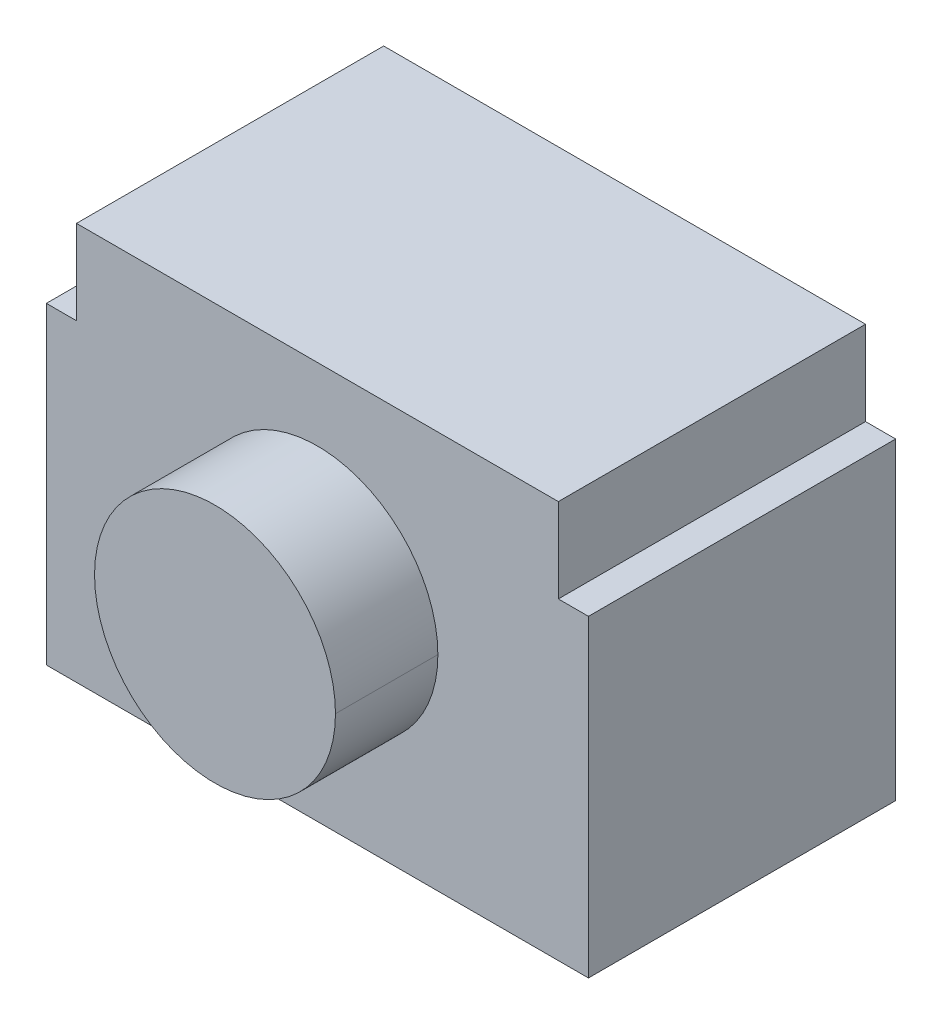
ISO-10303-21;
HEADER;
FILE_DESCRIPTION(('STEP AP214'),'2;1');
FILE_NAME('part.step','',(''),(''),'','','');
FILE_SCHEMA(('AUTOMOTIVE_DESIGN { 1 0 10303 214 1 1 1 1 }'));
ENDSEC;
DATA;
#1=APPLICATION_CONTEXT('core data for automotive mechanical design processes');
#2=APPLICATION_PROTOCOL_DEFINITION('international standard','automotive_design',2000,#1);
#3=PRODUCT_CONTEXT('',#1,'mechanical');
#4=PRODUCT('Part','Part','',(#3));
#5=PRODUCT_RELATED_PRODUCT_CATEGORY('part','',(#4));
#6=PRODUCT_DEFINITION_FORMATION('','',#4);
#7=PRODUCT_DEFINITION_CONTEXT('part definition',#1,'design');
#8=PRODUCT_DEFINITION('design','',#6,#7);
#9=PRODUCT_DEFINITION_SHAPE('','',#8);
#10=(LENGTH_UNIT() NAMED_UNIT(*) SI_UNIT(.MILLI.,.METRE.));
#11=(NAMED_UNIT(*) PLANE_ANGLE_UNIT() SI_UNIT($,.RADIAN.));
#12=(NAMED_UNIT(*) SI_UNIT($,.STERADIAN.) SOLID_ANGLE_UNIT());
#13=UNCERTAINTY_MEASURE_WITH_UNIT(LENGTH_MEASURE(1.E-05),#10,'distance_accuracy_value','');
#14=(GEOMETRIC_REPRESENTATION_CONTEXT(3) GLOBAL_UNCERTAINTY_ASSIGNED_CONTEXT((#13)) GLOBAL_UNIT_ASSIGNED_CONTEXT((#10,
#11,#12)) REPRESENTATION_CONTEXT('',''));
#15=CARTESIAN_POINT('',(0.,0.,0.));
#16=DIRECTION('',(0.,0.,1.));
#17=DIRECTION('',(1.,0.,0.));
#18=AXIS2_PLACEMENT_3D('',#15,#16,#17);
#19=CARTESIAN_POINT('',(0.,0.,-1.275));
#20=DIRECTION('',(0.,0.,-1.));
#21=DIRECTION('',(0.,-1.,0.));
#22=AXIS2_PLACEMENT_3D('',#19,#20,#21);
#23=PLANE('',#22);
#24=DIRECTION('',(0.,-1.,0.));
#25=VECTOR('',#24,1.);
#26=CARTESIAN_POINT('',(-2.,1.65,-1.275));
#27=LINE('',#26,#25);
#28=CARTESIAN_POINT('',(-2.,1.65,-1.275));
#29=VERTEX_POINT('',#28);
#30=CARTESIAN_POINT('',(-2.,0.95,-1.275));
#31=VERTEX_POINT('',#30);
#32=EDGE_CURVE('P0_E133',#29,#31,#27,.T.);
#33=ORIENTED_EDGE('',*,*,#32,.F.);
#34=DIRECTION('',(-1.,0.,0.));
#35=VECTOR('',#34,1.);
#36=CARTESIAN_POINT('',(2.,1.65,-1.275));
#37=LINE('',#36,#35);
#38=CARTESIAN_POINT('',(2.,1.65,-1.275));
#39=VERTEX_POINT('',#38);
#40=EDGE_CURVE('P0_E20',#39,#29,#37,.T.);
#41=ORIENTED_EDGE('',*,*,#40,.F.);
#42=DIRECTION('',(0.,1.,0.));
#43=VECTOR('',#42,1.);
#44=CARTESIAN_POINT('',(2.,1.65,-1.275));
#45=LINE('',#44,#43);
#46=CARTESIAN_POINT('',(2.,0.95,-1.275));
#47=VERTEX_POINT('',#46);
#48=EDGE_CURVE('P0_E90',#47,#39,#45,.T.);
#49=ORIENTED_EDGE('',*,*,#48,.F.);
#50=DIRECTION('',(-1.,0.,0.));
#51=VECTOR('',#50,1.);
#52=CARTESIAN_POINT('',(2.,0.95,-1.275));
#53=LINE('',#52,#51);
#54=CARTESIAN_POINT('',(2.25,0.95,-1.275));
#55=VERTEX_POINT('',#54);
#56=EDGE_CURVE('P0_E94',#55,#47,#53,.T.);
#57=ORIENTED_EDGE('',*,*,#56,.F.);
#58=DIRECTION('',(0.,1.,0.));
#59=VECTOR('',#58,1.);
#60=CARTESIAN_POINT('',(2.25,0.95,-1.275));
#61=LINE('',#60,#59);
#62=CARTESIAN_POINT('',(2.25,-1.65,-1.275));
#63=VERTEX_POINT('',#62);
#64=EDGE_CURVE('P0_E127',#63,#55,#61,.T.);
#65=ORIENTED_EDGE('',*,*,#64,.F.);
#66=DIRECTION('',(1.,0.,0.));
#67=VECTOR('',#66,1.);
#68=CARTESIAN_POINT('',(-2.25,-1.65,-1.275));
#69=LINE('',#68,#67);
#70=CARTESIAN_POINT('',(-2.25,-1.65,-1.275));
#71=VERTEX_POINT('',#70);
#72=EDGE_CURVE('P0_E169',#71,#63,#69,.T.);
#73=ORIENTED_EDGE('',*,*,#72,.F.);
#74=DIRECTION('',(0.,-1.,0.));
#75=VECTOR('',#74,1.);
#76=CARTESIAN_POINT('',(-2.25,0.95,-1.275));
#77=LINE('',#76,#75);
#78=CARTESIAN_POINT('',(-2.25,0.95,-1.275));
#79=VERTEX_POINT('',#78);
#80=EDGE_CURVE('P0_E147',#79,#71,#77,.T.);
#81=ORIENTED_EDGE('',*,*,#80,.F.);
#82=DIRECTION('',(-1.,0.,0.));
#83=VECTOR('',#82,1.);
#84=CARTESIAN_POINT('',(-2.,0.95,-1.275));
#85=LINE('',#84,#83);
#86=EDGE_CURVE('P0_E132',#31,#79,#85,.T.);
#87=ORIENTED_EDGE('',*,*,#86,.F.);
#88=EDGE_LOOP('',(#33,#41,#49,#57,#65,#73,#81,#87));
#89=FACE_BOUND('',#88,.T.);
#90=ADVANCED_FACE('P0_F17',(#89),#23,.T.);
#91=CARTESIAN_POINT('',(0.,0.,1.275));
#92=DIRECTION('',(0.,0.,-1.));
#93=DIRECTION('',(0.,-1.,0.));
#94=AXIS2_PLACEMENT_3D('',#91,#92,#93);
#95=PLANE('',#94);
#96=DIRECTION('',(0.,-1.,0.));
#97=VECTOR('',#96,1.);
#98=CARTESIAN_POINT('',(-2.,1.65,1.275));
#99=LINE('',#98,#97);
#100=CARTESIAN_POINT('',(-2.,1.65,1.275));
#101=VERTEX_POINT('',#100);
#102=CARTESIAN_POINT('',(-2.,0.95,1.275));
#103=VERTEX_POINT('',#102);
#104=EDGE_CURVE('P0_E141',#101,#103,#99,.T.);
#105=ORIENTED_EDGE('',*,*,#104,.T.);
#106=DIRECTION('',(-1.,0.,0.));
#107=VECTOR('',#106,1.);
#108=CARTESIAN_POINT('',(-2.,0.95,1.275));
#109=LINE('',#108,#107);
#110=CARTESIAN_POINT('',(-2.25,0.95,1.275));
#111=VERTEX_POINT('',#110);
#112=EDGE_CURVE('P0_E131',#103,#111,#109,.T.);
#113=ORIENTED_EDGE('',*,*,#112,.T.);
#114=DIRECTION('',(0.,-1.,0.));
#115=VECTOR('',#114,1.);
#116=CARTESIAN_POINT('',(-2.25,0.95,1.275));
#117=LINE('',#116,#115);
#118=CARTESIAN_POINT('',(-2.25,-1.65,1.275));
#119=VERTEX_POINT('',#118);
#120=EDGE_CURVE('P0_E146',#111,#119,#117,.T.);
#121=ORIENTED_EDGE('',*,*,#120,.T.);
#122=DIRECTION('',(1.,0.,0.));
#123=VECTOR('',#122,1.);
#124=CARTESIAN_POINT('',(-2.25,-1.65,1.275));
#125=LINE('',#124,#123);
#126=CARTESIAN_POINT('',(2.25,-1.65,1.275));
#127=VERTEX_POINT('',#126);
#128=EDGE_CURVE('P0_E168',#119,#127,#125,.T.);
#129=ORIENTED_EDGE('',*,*,#128,.T.);
#130=DIRECTION('',(0.,1.,0.));
#131=VECTOR('',#130,1.);
#132=CARTESIAN_POINT('',(2.25,0.95,1.275));
#133=LINE('',#132,#131);
#134=CARTESIAN_POINT('',(2.25,0.95,1.275));
#135=VERTEX_POINT('',#134);
#136=EDGE_CURVE('P0_E116',#127,#135,#133,.T.);
#137=ORIENTED_EDGE('',*,*,#136,.T.);
#138=DIRECTION('',(-1.,0.,0.));
#139=VECTOR('',#138,1.);
#140=CARTESIAN_POINT('',(2.,0.95,1.275));
#141=LINE('',#140,#139);
#142=CARTESIAN_POINT('',(2.,0.95,1.275));
#143=VERTEX_POINT('',#142);
#144=EDGE_CURVE('P0_E101',#135,#143,#141,.T.);
#145=ORIENTED_EDGE('',*,*,#144,.T.);
#146=DIRECTION('',(0.,1.,0.));
#147=VECTOR('',#146,1.);
#148=CARTESIAN_POINT('',(2.,1.65,1.275));
#149=LINE('',#148,#147);
#150=CARTESIAN_POINT('',(2.,1.65,1.275));
#151=VERTEX_POINT('',#150);
#152=EDGE_CURVE('P0_E106',#143,#151,#149,.T.);
#153=ORIENTED_EDGE('',*,*,#152,.T.);
#154=DIRECTION('',(-1.,0.,0.));
#155=VECTOR('',#154,1.);
#156=CARTESIAN_POINT('',(2.,1.65,1.275));
#157=LINE('',#156,#155);
#158=EDGE_CURVE('P0_E11',#151,#101,#157,.T.);
#159=ORIENTED_EDGE('',*,*,#158,.T.);
#160=EDGE_LOOP('',(#105,#113,#121,#129,#137,#145,#153,#159));
#161=FACE_BOUND('',#160,.T.);
#162=ADVANCED_FACE('P0_F225',(#161),#95,.F.);
#163=CARTESIAN_POINT('',(2.,1.65,1.275));
#164=DIRECTION('',(0.,-1.,0.));
#165=DIRECTION('',(0.,0.,-1.));
#166=AXIS2_PLACEMENT_3D('',#163,#164,#165);
#167=PLANE('',#166);
#168=ORIENTED_EDGE('',*,*,#40,.T.);
#169=DIRECTION('',(0.,0.,-1.));
#170=VECTOR('',#169,1.);
#171=CARTESIAN_POINT('',(-2.,1.65,1.275));
#172=LINE('',#171,#170);
#173=EDGE_CURVE('P0_E151',#101,#29,#172,.T.);
#174=ORIENTED_EDGE('',*,*,#173,.F.);
#175=ORIENTED_EDGE('',*,*,#158,.F.);
#176=DIRECTION('',(0.,0.,-1.));
#177=VECTOR('',#176,1.);
#178=CARTESIAN_POINT('',(2.,1.65,1.275));
#179=LINE('',#178,#177);
#180=EDGE_CURVE('P0_E100',#151,#39,#179,.T.);
#181=ORIENTED_EDGE('',*,*,#180,.T.);
#182=EDGE_LOOP('',(#168,#174,#175,#181));
#183=FACE_BOUND('',#182,.T.);
#184=ADVANCED_FACE('P0_F193',(#183),#167,.F.);
#185=CARTESIAN_POINT('',(2.,1.65,1.275));
#186=DIRECTION('',(-1.,0.,0.));
#187=DIRECTION('',(0.,0.,1.));
#188=AXIS2_PLACEMENT_3D('',#185,#186,#187);
#189=PLANE('',#188);
#190=ORIENTED_EDGE('',*,*,#48,.T.);
#191=ORIENTED_EDGE('',*,*,#180,.F.);
#192=ORIENTED_EDGE('',*,*,#152,.F.);
#193=DIRECTION('',(0.,0.,-1.));
#194=VECTOR('',#193,1.);
#195=CARTESIAN_POINT('',(2.,0.95,1.275));
#196=LINE('',#195,#194);
#197=EDGE_CURVE('P0_E104',#143,#47,#196,.T.);
#198=ORIENTED_EDGE('',*,*,#197,.T.);
#199=EDGE_LOOP('',(#190,#191,#192,#198));
#200=FACE_BOUND('',#199,.T.);
#201=ADVANCED_FACE('P0_F105',(#200),#189,.F.);
#202=CARTESIAN_POINT('',(2.,0.95,1.275));
#203=DIRECTION('',(0.,-1.,0.));
#204=DIRECTION('',(0.,0.,-1.));
#205=AXIS2_PLACEMENT_3D('',#202,#203,#204);
#206=PLANE('',#205);
#207=ORIENTED_EDGE('',*,*,#56,.T.);
#208=ORIENTED_EDGE('',*,*,#197,.F.);
#209=ORIENTED_EDGE('',*,*,#144,.F.);
#210=DIRECTION('',(0.,0.,-1.));
#211=VECTOR('',#210,1.);
#212=CARTESIAN_POINT('',(2.25,0.95,1.275));
#213=LINE('',#212,#211);
#214=EDGE_CURVE('P0_E113',#135,#55,#213,.T.);
#215=ORIENTED_EDGE('',*,*,#214,.T.);
#216=EDGE_LOOP('',(#207,#208,#209,#215));
#217=FACE_BOUND('',#216,.T.);
#218=ADVANCED_FACE('P0_F111',(#217),#206,.F.);
#219=CARTESIAN_POINT('',(2.25,0.95,1.275));
#220=DIRECTION('',(-1.,0.,0.));
#221=DIRECTION('',(0.,0.,1.));
#222=AXIS2_PLACEMENT_3D('',#219,#220,#221);
#223=PLANE('',#222);
#224=ORIENTED_EDGE('',*,*,#64,.T.);
#225=ORIENTED_EDGE('',*,*,#214,.F.);
#226=ORIENTED_EDGE('',*,*,#136,.F.);
#227=DIRECTION('',(0.,0.,-1.));
#228=VECTOR('',#227,1.);
#229=CARTESIAN_POINT('',(2.25,-1.65,1.275));
#230=LINE('',#229,#228);
#231=EDGE_CURVE('P0_E164',#127,#63,#230,.T.);
#232=ORIENTED_EDGE('',*,*,#231,.T.);
#233=EDGE_LOOP('',(#224,#225,#226,#232));
#234=FACE_BOUND('',#233,.T.);
#235=ADVANCED_FACE('P0_F258',(#234),#223,.F.);
#236=CARTESIAN_POINT('',(-2.25,-1.65,1.275));
#237=DIRECTION('',(0.,1.,0.));
#238=DIRECTION('',(1.,0.,0.));
#239=AXIS2_PLACEMENT_3D('',#236,#237,#238);
#240=PLANE('',#239);
#241=ORIENTED_EDGE('',*,*,#72,.T.);
#242=ORIENTED_EDGE('',*,*,#231,.F.);
#243=ORIENTED_EDGE('',*,*,#128,.F.);
#244=DIRECTION('',(0.,0.,-1.));
#245=VECTOR('',#244,1.);
#246=CARTESIAN_POINT('',(-2.25,-1.65,1.275));
#247=LINE('',#246,#245);
#248=EDGE_CURVE('P0_E142',#119,#71,#247,.T.);
#249=ORIENTED_EDGE('',*,*,#248,.T.);
#250=EDGE_LOOP('',(#241,#242,#243,#249));
#251=FACE_BOUND('',#250,.T.);
#252=ADVANCED_FACE('P0_F263',(#251),#240,.F.);
#253=CARTESIAN_POINT('',(-2.25,0.95,1.275));
#254=DIRECTION('',(1.,0.,0.));
#255=DIRECTION('',(0.,1.,0.));
#256=AXIS2_PLACEMENT_3D('',#253,#254,#255);
#257=PLANE('',#256);
#258=ORIENTED_EDGE('',*,*,#80,.T.);
#259=ORIENTED_EDGE('',*,*,#248,.F.);
#260=ORIENTED_EDGE('',*,*,#120,.F.);
#261=DIRECTION('',(0.,0.,-1.));
#262=VECTOR('',#261,1.);
#263=CARTESIAN_POINT('',(-2.25,0.95,1.275));
#264=LINE('',#263,#262);
#265=EDGE_CURVE('P0_E128',#111,#79,#264,.T.);
#266=ORIENTED_EDGE('',*,*,#265,.T.);
#267=EDGE_LOOP('',(#258,#259,#260,#266));
#268=FACE_BOUND('',#267,.T.);
#269=ADVANCED_FACE('P0_F274',(#268),#257,.F.);
#270=CARTESIAN_POINT('',(-2.,0.95,1.275));
#271=DIRECTION('',(0.,-1.,0.));
#272=DIRECTION('',(-1.,0.,0.));
#273=AXIS2_PLACEMENT_3D('',#270,#271,#272);
#274=PLANE('',#273);
#275=ORIENTED_EDGE('',*,*,#86,.T.);
#276=ORIENTED_EDGE('',*,*,#265,.F.);
#277=ORIENTED_EDGE('',*,*,#112,.F.);
#278=DIRECTION('',(0.,0.,-1.));
#279=VECTOR('',#278,1.);
#280=CARTESIAN_POINT('',(-2.,0.95,1.275));
#281=LINE('',#280,#279);
#282=EDGE_CURVE('P0_E137',#103,#31,#281,.T.);
#283=ORIENTED_EDGE('',*,*,#282,.T.);
#284=EDGE_LOOP('',(#275,#276,#277,#283));
#285=FACE_BOUND('',#284,.T.);
#286=ADVANCED_FACE('P0_F206',(#285),#274,.F.);
#287=CARTESIAN_POINT('',(-2.,1.65,1.275));
#288=DIRECTION('',(1.,0.,0.));
#289=DIRECTION('',(0.,1.,0.));
#290=AXIS2_PLACEMENT_3D('',#287,#288,#289);
#291=PLANE('',#290);
#292=ORIENTED_EDGE('',*,*,#32,.T.);
#293=ORIENTED_EDGE('',*,*,#282,.F.);
#294=ORIENTED_EDGE('',*,*,#104,.F.);
#295=ORIENTED_EDGE('',*,*,#173,.T.);
#296=EDGE_LOOP('',(#292,#293,#294,#295));
#297=FACE_BOUND('',#296,.T.);
#298=ADVANCED_FACE('P0_F199',(#297),#291,.F.);
#299=CLOSED_SHELL('',(#90,#162,#184,#201,#218,#235,#252,#269,#286,#298));
#300=MANIFOLD_SOLID_BREP('P0_B1',#299);
#301=CARTESIAN_POINT('',(0.,0.05,1.275));
#302=DIRECTION('',(0.,0.,1.));
#303=DIRECTION('',(1.,0.,0.));
#304=AXIS2_PLACEMENT_3D('',#301,#302,#303);
#305=PLANE('',#304);
#306=CARTESIAN_POINT('',(0.,0.05,1.275));
#307=DIRECTION('',(0.,0.,1.));
#308=DIRECTION('',(1.,0.,0.));
#309=AXIS2_PLACEMENT_3D('',#306,#307,#308);
#310=CIRCLE('',#309,1.);
#311=CARTESIAN_POINT('',(-1.,0.05,1.275));
#312=VERTEX_POINT('',#311);
#313=CARTESIAN_POINT('',(1.,0.05,1.275));
#314=VERTEX_POINT('',#313);
#315=EDGE_CURVE('P1_E11',#312,#314,#310,.T.);
#316=ORIENTED_EDGE('',*,*,#315,.F.);
#317=CARTESIAN_POINT('',(0.,0.05,1.275));
#318=DIRECTION('',(0.,0.,1.));
#319=DIRECTION('',(1.,0.,0.));
#320=AXIS2_PLACEMENT_3D('',#317,#318,#319);
#321=CIRCLE('',#320,1.);
#322=EDGE_CURVE('P1_E66',#314,#312,#321,.T.);
#323=ORIENTED_EDGE('',*,*,#322,.F.);
#324=EDGE_LOOP('',(#316,#323));
#325=FACE_BOUND('',#324,.T.);
#326=ADVANCED_FACE('P1_F17',(#325),#305,.F.);
#327=CARTESIAN_POINT('',(0.,0.05,2.125));
#328=DIRECTION('',(0.,0.,1.));
#329=DIRECTION('',(1.,0.,0.));
#330=AXIS2_PLACEMENT_3D('',#327,#328,#329);
#331=PLANE('',#330);
#332=CARTESIAN_POINT('',(0.,0.05,2.125));
#333=DIRECTION('',(0.,0.,1.));
#334=DIRECTION('',(1.,0.,0.));
#335=AXIS2_PLACEMENT_3D('',#332,#333,#334);
#336=CIRCLE('',#335,1.);
#337=CARTESIAN_POINT('',(-1.,0.05,2.125));
#338=VERTEX_POINT('',#337);
#339=CARTESIAN_POINT('',(1.,0.05,2.125));
#340=VERTEX_POINT('',#339);
#341=EDGE_CURVE('P1_E25',#338,#340,#336,.T.);
#342=ORIENTED_EDGE('',*,*,#341,.T.);
#343=CARTESIAN_POINT('',(0.,0.05,2.125));
#344=DIRECTION('',(0.,0.,1.));
#345=DIRECTION('',(1.,0.,0.));
#346=AXIS2_PLACEMENT_3D('',#343,#344,#345);
#347=CIRCLE('',#346,1.);
#348=EDGE_CURVE('P1_E56',#340,#338,#347,.T.);
#349=ORIENTED_EDGE('',*,*,#348,.T.);
#350=EDGE_LOOP('',(#342,#349));
#351=FACE_BOUND('',#350,.T.);
#352=ADVANCED_FACE('P1_F54',(#351),#331,.T.);
#353=CARTESIAN_POINT('',(0.,0.05,2.125));
#354=DIRECTION('',(0.,0.,-1.));
#355=DIRECTION('',(-1.,0.,0.));
#356=AXIS2_PLACEMENT_3D('',#353,#354,#355);
#357=CYLINDRICAL_SURFACE('',#356,1.);
#358=DIRECTION('',(0.,0.,-1.));
#359=VECTOR('',#358,1.);
#360=CARTESIAN_POINT('',(1.,0.05,2.125));
#361=LINE('',#360,#359);
#362=EDGE_CURVE('P1_E61',#340,#314,#361,.T.);
#363=ORIENTED_EDGE('',*,*,#362,.F.);
#364=ORIENTED_EDGE('',*,*,#341,.F.);
#365=DIRECTION('',(0.,0.,-1.));
#366=VECTOR('',#365,1.);
#367=CARTESIAN_POINT('',(-1.,0.05,2.125));
#368=LINE('',#367,#366);
#369=EDGE_CURVE('P1_E59',#338,#312,#368,.T.);
#370=ORIENTED_EDGE('',*,*,#369,.T.);
#371=ORIENTED_EDGE('',*,*,#315,.T.);
#372=EDGE_LOOP('',(#363,#364,#370,#371));
#373=FACE_BOUND('',#372,.T.);
#374=ADVANCED_FACE('P1_F62',(#373),#357,.T.);
#375=CARTESIAN_POINT('',(0.,0.05,2.125));
#376=DIRECTION('',(0.,0.,-1.));
#377=DIRECTION('',(-1.,0.,0.));
#378=AXIS2_PLACEMENT_3D('',#375,#376,#377);
#379=CYLINDRICAL_SURFACE('',#378,1.);
#380=ORIENTED_EDGE('',*,*,#348,.F.);
#381=ORIENTED_EDGE('',*,*,#362,.T.);
#382=ORIENTED_EDGE('',*,*,#322,.T.);
#383=ORIENTED_EDGE('',*,*,#369,.F.);
#384=EDGE_LOOP('',(#380,#381,#382,#383));
#385=FACE_BOUND('',#384,.T.);
#386=ADVANCED_FACE('P1_F68',(#385),#379,.T.);
#387=CLOSED_SHELL('',(#326,#352,#374,#386));
#388=MANIFOLD_SOLID_BREP('P1_B1',#387);
#389=ADVANCED_BREP_SHAPE_REPRESENTATION('',(#18,#300,#388),#14);
#390=SHAPE_DEFINITION_REPRESENTATION(#9,#389);
ENDSEC;
END-ISO-10303-21;
